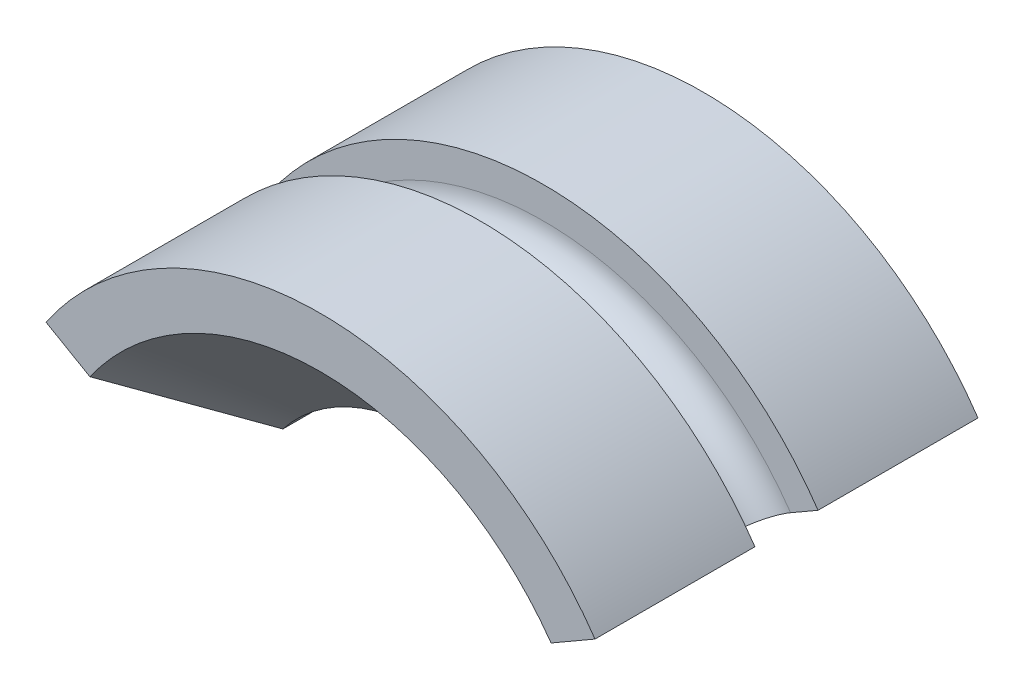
ISO-10303-21;
HEADER;
FILE_DESCRIPTION(('STEP AP214'),'2;1');
FILE_NAME('part.step','',(''),(''),'','','');
FILE_SCHEMA(('AUTOMOTIVE_DESIGN { 1 0 10303 214 1 1 1 1 }'));
ENDSEC;
DATA;
#1=APPLICATION_CONTEXT('core data for automotive mechanical design processes');
#2=APPLICATION_PROTOCOL_DEFINITION('international standard','automotive_design',2000,#1);
#3=PRODUCT_CONTEXT('',#1,'mechanical');
#4=PRODUCT('Part','Part','',(#3));
#5=PRODUCT_RELATED_PRODUCT_CATEGORY('part','',(#4));
#6=PRODUCT_DEFINITION_FORMATION('','',#4);
#7=PRODUCT_DEFINITION_CONTEXT('part definition',#1,'design');
#8=PRODUCT_DEFINITION('design','',#6,#7);
#9=PRODUCT_DEFINITION_SHAPE('','',#8);
#10=(LENGTH_UNIT() NAMED_UNIT(*) SI_UNIT(.MILLI.,.METRE.));
#11=(NAMED_UNIT(*) PLANE_ANGLE_UNIT() SI_UNIT($,.RADIAN.));
#12=(NAMED_UNIT(*) SI_UNIT($,.STERADIAN.) SOLID_ANGLE_UNIT());
#13=UNCERTAINTY_MEASURE_WITH_UNIT(LENGTH_MEASURE(1.E-05),#10,'distance_accuracy_value','');
#14=(GEOMETRIC_REPRESENTATION_CONTEXT(3) GLOBAL_UNCERTAINTY_ASSIGNED_CONTEXT((#13)) GLOBAL_UNIT_ASSIGNED_CONTEXT((#10,
#11,#12)) REPRESENTATION_CONTEXT('',''));
#15=CARTESIAN_POINT('',(0.,0.,0.));
#16=DIRECTION('',(0.,0.,1.));
#17=DIRECTION('',(1.,0.,0.));
#18=AXIS2_PLACEMENT_3D('',#15,#16,#17);
#19=CARTESIAN_POINT('',(0.,0.,0.));
#20=DIRECTION('',(0.,0.,-1.));
#21=DIRECTION('',(0.,1.,0.));
#22=AXIS2_PLACEMENT_3D('',#19,#20,#21);
#23=CYLINDRICAL_SURFACE('',#22,7.9);
#24=CARTESIAN_POINT('',(0.,0.,5.3));
#25=DIRECTION('',(0.,0.,-1.));
#26=DIRECTION('',(0.,1.,0.));
#27=AXIS2_PLACEMENT_3D('',#24,#25,#26);
#28=CIRCLE('',#27,7.9);
#29=CARTESIAN_POINT('',(-6.52183992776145,4.45820636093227,5.3));
#30=VERTEX_POINT('',#29);
#31=CARTESIAN_POINT('',(6.52183992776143,4.45820636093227,5.29999999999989));
#32=VERTEX_POINT('',#31);
#33=EDGE_CURVE('E109',#30,#32,#28,.T.);
#34=ORIENTED_EDGE('',*,*,#33,.F.);
#35=DIRECTION('',(0.,0.,-1.));
#36=VECTOR('',#35,1.);
#37=CARTESIAN_POINT('',(-6.52183992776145,4.45820636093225,9.1));
#38=LINE('',#37,#36);
#39=CARTESIAN_POINT('',(-6.52183992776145,4.45820636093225,9.1));
#40=VERTEX_POINT('',#39);
#41=EDGE_CURVE('E92',#40,#30,#38,.T.);
#42=ORIENTED_EDGE('',*,*,#41,.F.);
#43=CARTESIAN_POINT('',(0.,0.,9.1));
#44=DIRECTION('',(0.,0.,-1.));
#45=DIRECTION('',(0.,1.,0.));
#46=AXIS2_PLACEMENT_3D('',#43,#44,#45);
#47=CIRCLE('',#46,7.9);
#48=CARTESIAN_POINT('',(6.52183992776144,4.45820636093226,9.1));
#49=VERTEX_POINT('',#48);
#50=EDGE_CURVE('E107',#40,#49,#47,.T.);
#51=ORIENTED_EDGE('',*,*,#50,.T.);
#52=DIRECTION('',(0.,0.,-1.));
#53=VECTOR('',#52,1.);
#54=CARTESIAN_POINT('',(6.52183992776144,4.45820636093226,9.1));
#55=LINE('',#54,#53);
#56=EDGE_CURVE('E248',#49,#32,#55,.T.);
#57=ORIENTED_EDGE('',*,*,#56,.T.);
#58=EDGE_LOOP('',(#34,#42,#51,#57));
#59=FACE_BOUND('',#58,.T.);
#60=ADVANCED_FACE('F14',(#59),#23,.T.);
#61=CARTESIAN_POINT('',(0.,0.,9.1));
#62=DIRECTION('',(0.,0.,1.));
#63=DIRECTION('',(0.,-1.,0.));
#64=AXIS2_PLACEMENT_3D('',#61,#62,#63);
#65=CONICAL_SURFACE('',#64,6.7,0.785398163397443);
#66=CARTESIAN_POINT('',(0.,0.,9.1));
#67=DIRECTION('',(0.,0.,-1.));
#68=DIRECTION('',(0.,1.,0.));
#69=AXIS2_PLACEMENT_3D('',#66,#67,#68);
#70=CIRCLE('',#69,6.7);
#71=CARTESIAN_POINT('',(-5.47905701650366,3.85615536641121,9.1));
#72=VERTEX_POINT('',#71);
#73=CARTESIAN_POINT('',(5.47905701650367,3.85615536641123,9.1));
#74=VERTEX_POINT('',#73);
#75=EDGE_CURVE('E116',#72,#74,#70,.T.);
#76=ORIENTED_EDGE('',*,*,#75,.F.);
#77=CARTESIAN_POINT('',(-5.4792309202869,3.85625576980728,9.1002));
#78=CARTESIAN_POINT('',(-5.30146466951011,3.75362237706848,8.8957612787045));
#79=CARTESIAN_POINT('',(-5.12366859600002,3.65097176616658,8.69135711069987));
#80=CARTESIAN_POINT('',(-4.76798819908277,3.44561959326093,8.28265139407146));
#81=CARTESIAN_POINT('',(-4.59010387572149,3.34291803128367,8.07834984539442));
#82=CARTESIAN_POINT('',(-4.23421813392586,3.13744730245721,7.66988260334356));
#83=CARTESIAN_POINT('',(-4.05621671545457,3.03467813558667,7.46571691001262));
#84=CARTESIAN_POINT('',(-3.70003888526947,2.82903876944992,7.05758895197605));
#85=CARTESIAN_POINT('',(-3.52186247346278,2.7261685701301,6.85362668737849));
#86=CARTESIAN_POINT('',(-3.34356968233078,2.62323117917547,6.6498));
#87=B_SPLINE_CURVE_WITH_KNOTS('',3,(#77,#78,#79,#80,#81,#82,#83,#84,#85,#86),.UNSPECIFIED.,.F.,
.F.,(4,2,2,2,4),(0.,0.869118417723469,1.73823638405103,2.60735462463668,3.47647332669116),.UNSPECIFIED.);
#88=CARTESIAN_POINT('',(-3.34374463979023,2.62333219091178,6.65));
#89=VERTEX_POINT('',#88);
#90=EDGE_CURVE('E95',#72,#89,#87,.T.);
#91=ORIENTED_EDGE('',*,*,#90,.T.);
#92=CARTESIAN_POINT('',(0.,0.,6.65));
#93=DIRECTION('',(0.,0.,-1.));
#94=DIRECTION('',(0.,1.,0.));
#95=AXIS2_PLACEMENT_3D('',#92,#93,#94);
#96=CIRCLE('',#95,4.25);
#97=CARTESIAN_POINT('',(3.34374463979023,2.6233321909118,6.65));
#98=VERTEX_POINT('',#97);
#99=EDGE_CURVE('E130',#89,#98,#96,.T.);
#100=ORIENTED_EDGE('',*,*,#99,.T.);
#101=CARTESIAN_POINT('',(3.34356968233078,2.62323117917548,6.6498));
#102=CARTESIAN_POINT('',(3.52186247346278,2.7261685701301,6.8536266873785));
#103=CARTESIAN_POINT('',(3.70003888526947,2.82903876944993,7.05758895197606));
#104=CARTESIAN_POINT('',(4.05621671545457,3.03467813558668,7.46571691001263));
#105=CARTESIAN_POINT('',(4.23421813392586,3.13744730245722,7.66988260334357));
#106=CARTESIAN_POINT('',(4.59010387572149,3.34291803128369,8.07834984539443));
#107=CARTESIAN_POINT('',(4.76798819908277,3.44561959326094,8.28265139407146));
#108=CARTESIAN_POINT('',(5.12366859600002,3.65097176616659,8.69135711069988));
#109=CARTESIAN_POINT('',(5.30146466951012,3.7536223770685,8.89576127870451));
#110=CARTESIAN_POINT('',(5.47923092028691,3.8562557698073,9.1002));
#111=B_SPLINE_CURVE_WITH_KNOTS('',3,(#101,#102,#103,#104,#105,#106,#107,#108,#109,#110),
.UNSPECIFIED.,.F.,.F.,(4,2,2,2,4),(0.,0.869118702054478,1.73823694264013,2.60735490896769,
3.47647332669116),.UNSPECIFIED.);
#112=EDGE_CURVE('E181',#98,#74,#111,.T.);
#113=ORIENTED_EDGE('',*,*,#112,.T.);
#114=EDGE_LOOP('',(#76,#91,#100,#113));
#115=FACE_BOUND('',#114,.T.);
#116=ADVANCED_FACE('F16',(#115),#65,.F.);
#117=CARTESIAN_POINT('',(0.,0.,0.));
#118=DIRECTION('',(0.,0.,-1.));
#119=DIRECTION('',(0.,1.,0.));
#120=AXIS2_PLACEMENT_3D('',#117,#118,#119);
#121=CYLINDRICAL_SURFACE('',#120,4.25);
#122=ORIENTED_EDGE('',*,*,#99,.F.);
#123=DIRECTION('',(0.,0.,-1.));
#124=VECTOR('',#123,1.);
#125=CARTESIAN_POINT('',(-3.34374463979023,2.6233321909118,9.1));
#126=LINE('',#125,#124);
#127=CARTESIAN_POINT('',(-3.34374463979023,2.62333219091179,2.45));
#128=VERTEX_POINT('',#127);
#129=EDGE_CURVE('E110',#89,#128,#126,.T.);
#130=ORIENTED_EDGE('',*,*,#129,.T.);
#131=CARTESIAN_POINT('',(0.,0.,2.45000000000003));
#132=DIRECTION('',(0.,0.,-1.));
#133=DIRECTION('',(0.,1.,0.));
#134=AXIS2_PLACEMENT_3D('',#131,#132,#133);
#135=CIRCLE('',#134,4.25);
#136=CARTESIAN_POINT('',(3.34374463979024,2.6233321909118,2.45));
#137=VERTEX_POINT('',#136);
#138=EDGE_CURVE('E127',#128,#137,#135,.T.);
#139=ORIENTED_EDGE('',*,*,#138,.T.);
#140=DIRECTION('',(0.,0.,-1.));
#141=VECTOR('',#140,1.);
#142=CARTESIAN_POINT('',(3.34374463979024,2.62333219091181,9.1));
#143=LINE('',#142,#141);
#144=EDGE_CURVE('E246',#98,#137,#143,.T.);
#145=ORIENTED_EDGE('',*,*,#144,.F.);
#146=EDGE_LOOP('',(#122,#130,#139,#145));
#147=FACE_BOUND('',#146,.T.);
#148=ADVANCED_FACE('F209',(#147),#121,.F.);
#149=CARTESIAN_POINT('',(0.,0.,2.45000000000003));
#150=DIRECTION('',(0.,0.,-1.));
#151=DIRECTION('',(0.,1.,0.));
#152=AXIS2_PLACEMENT_3D('',#149,#150,#151);
#153=CONICAL_SURFACE('',#152,4.25,0.785398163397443);
#154=ORIENTED_EDGE('',*,*,#138,.F.);
#155=CARTESIAN_POINT('',(-3.34356968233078,2.62323117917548,2.4502));
#156=CARTESIAN_POINT('',(-3.52186247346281,2.72616857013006,2.2463733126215));
#157=CARTESIAN_POINT('',(-3.70003888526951,2.82903876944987,2.04241104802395));
#158=CARTESIAN_POINT('',(-4.05621671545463,3.0346781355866,1.63428308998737));
#159=CARTESIAN_POINT('',(-4.23421813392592,3.13744730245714,1.43011739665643));
#160=CARTESIAN_POINT('',(-4.59010387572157,3.34291803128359,1.02165015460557));
#161=CARTESIAN_POINT('',(-4.76798819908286,3.44561959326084,0.817348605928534));
#162=CARTESIAN_POINT('',(-5.1236685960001,3.6509717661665,0.408642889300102));
#163=CARTESIAN_POINT('',(-5.30146466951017,3.75362237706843,0.20423872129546));
#164=CARTESIAN_POINT('',(-5.47923092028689,3.85625576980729,-0.000200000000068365));
#165=B_SPLINE_CURVE_WITH_KNOTS('',3,(#155,#156,#157,#158,#159,#160,#161,#162,#163,#164),
.UNSPECIFIED.,.F.,.F.,(4,2,2,2,4),(0.,0.869118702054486,1.73823694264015,2.60735490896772,
3.4764733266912),.UNSPECIFIED.);
#166=CARTESIAN_POINT('',(-5.47905701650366,3.85615536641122,0.));
#167=VERTEX_POINT('',#166);
#168=EDGE_CURVE('E160',#128,#167,#165,.T.);
#169=ORIENTED_EDGE('',*,*,#168,.T.);
#170=CARTESIAN_POINT('',(0.,0.,0.));
#171=DIRECTION('',(0.,0.,-1.));
#172=DIRECTION('',(0.,1.,0.));
#173=AXIS2_PLACEMENT_3D('',#170,#171,#172);
#174=CIRCLE('',#173,6.7);
#175=CARTESIAN_POINT('',(5.47905701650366,3.85615536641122,0.));
#176=VERTEX_POINT('',#175);
#177=EDGE_CURVE('E119',#167,#176,#174,.T.);
#178=ORIENTED_EDGE('',*,*,#177,.T.);
#179=CARTESIAN_POINT('',(5.47923092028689,3.85625576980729,-0.000200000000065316));
#180=CARTESIAN_POINT('',(5.30146466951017,3.75362237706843,0.204238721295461));
#181=CARTESIAN_POINT('',(5.1236685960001,3.6509717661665,0.408642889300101));
#182=CARTESIAN_POINT('',(4.76798819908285,3.44561959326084,0.817348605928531));
#183=CARTESIAN_POINT('',(4.59010387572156,3.3429180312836,1.02165015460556));
#184=CARTESIAN_POINT('',(4.23421813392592,3.13744730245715,1.43011739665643));
#185=CARTESIAN_POINT('',(4.05621671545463,3.03467813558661,1.63428308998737));
#186=CARTESIAN_POINT('',(3.70003888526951,2.82903876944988,2.04241104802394));
#187=CARTESIAN_POINT('',(3.52186247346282,2.72616857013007,2.2463733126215));
#188=CARTESIAN_POINT('',(3.34356968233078,2.62323117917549,2.4502));
#189=B_SPLINE_CURVE_WITH_KNOTS('',3,(#179,#180,#181,#182,#183,#184,#185,#186,#187,#188),
.UNSPECIFIED.,.F.,.F.,(4,2,2,2,4),(0.,0.869118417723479,1.73823638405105,2.60735462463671,
3.4764733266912),.UNSPECIFIED.);
#190=EDGE_CURVE('E198',#176,#137,#189,.T.);
#191=ORIENTED_EDGE('',*,*,#190,.T.);
#192=EDGE_LOOP('',(#154,#169,#178,#191));
#193=FACE_BOUND('',#192,.T.);
#194=ADVANCED_FACE('F204',(#193),#153,.F.);
#195=CARTESIAN_POINT('',(6.7,0.,0.));
#196=DIRECTION('',(0.,0.,-1.));
#197=DIRECTION('',(0.,1.,0.));
#198=AXIS2_PLACEMENT_3D('',#195,#196,#197);
#199=PLANE('',#198);
#200=ORIENTED_EDGE('',*,*,#177,.F.);
#201=DIRECTION('',(-0.86602540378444,0.5,0.));
#202=VECTOR('',#201,1.);
#203=CARTESIAN_POINT('',(-3.34374463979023,2.62333219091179,0.));
#204=LINE('',#203,#202);
#205=CARTESIAN_POINT('',(-6.52183992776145,4.45820636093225,0.));
#206=VERTEX_POINT('',#205);
#207=EDGE_CURVE('E240',#167,#206,#204,.T.);
#208=ORIENTED_EDGE('',*,*,#207,.T.);
#209=CARTESIAN_POINT('',(0.,0.,0.));
#210=DIRECTION('',(0.,0.,-1.));
#211=DIRECTION('',(0.,1.,0.));
#212=AXIS2_PLACEMENT_3D('',#209,#210,#211);
#213=CIRCLE('',#212,7.9);
#214=CARTESIAN_POINT('',(6.52183992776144,4.45820636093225,0.));
#215=VERTEX_POINT('',#214);
#216=EDGE_CURVE('E115',#206,#215,#213,.T.);
#217=ORIENTED_EDGE('',*,*,#216,.T.);
#218=DIRECTION('',(-0.866025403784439,-0.5,0.));
#219=VECTOR('',#218,1.);
#220=CARTESIAN_POINT('',(3.34374463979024,2.6233321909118,0.));
#221=LINE('',#220,#219);
#222=EDGE_CURVE('E101',#215,#176,#221,.T.);
#223=ORIENTED_EDGE('',*,*,#222,.T.);
#224=EDGE_LOOP('',(#200,#208,#217,#223));
#225=FACE_BOUND('',#224,.T.);
#226=ADVANCED_FACE('F208',(#225),#199,.T.);
#227=ORIENTED_EDGE('',*,*,#216,.F.);
#228=CARTESIAN_POINT('',(-6.52183992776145,4.45820636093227,3.79999999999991));
#229=VERTEX_POINT('',#228);
#230=EDGE_CURVE('E111',#229,#206,#38,.T.);
#231=ORIENTED_EDGE('',*,*,#230,.F.);
#232=CARTESIAN_POINT('',(0.,0.,3.8));
#233=DIRECTION('',(0.,0.,-1.));
#234=DIRECTION('',(0.,1.,0.));
#235=AXIS2_PLACEMENT_3D('',#232,#233,#234);
#236=CIRCLE('',#235,7.9);
#237=CARTESIAN_POINT('',(6.52183992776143,4.45820636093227,3.7999999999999));
#238=VERTEX_POINT('',#237);
#239=EDGE_CURVE('E149',#229,#238,#236,.T.);
#240=ORIENTED_EDGE('',*,*,#239,.T.);
#241=EDGE_CURVE('E37',#238,#215,#55,.T.);
#242=ORIENTED_EDGE('',*,*,#241,.T.);
#243=EDGE_LOOP('',(#227,#231,#240,#242));
#244=FACE_BOUND('',#243,.T.);
#245=ADVANCED_FACE('F223',(#244),#23,.T.);
#246=CARTESIAN_POINT('',(7.9,0.,9.1));
#247=DIRECTION('',(0.,0.,1.));
#248=DIRECTION('',(0.,-1.,0.));
#249=AXIS2_PLACEMENT_3D('',#246,#247,#248);
#250=PLANE('',#249);
#251=ORIENTED_EDGE('',*,*,#50,.F.);
#252=DIRECTION('',(-0.86602540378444,0.5,0.));
#253=VECTOR('',#252,1.);
#254=CARTESIAN_POINT('',(-3.34374463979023,2.6233321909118,9.1));
#255=LINE('',#254,#253);
#256=EDGE_CURVE('E89',#72,#40,#255,.T.);
#257=ORIENTED_EDGE('',*,*,#256,.F.);
#258=ORIENTED_EDGE('',*,*,#75,.T.);
#259=DIRECTION('',(-0.866025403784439,-0.5,0.));
#260=VECTOR('',#259,1.);
#261=CARTESIAN_POINT('',(3.34374463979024,2.62333219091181,9.1));
#262=LINE('',#261,#260);
#263=EDGE_CURVE('E100',#49,#74,#262,.T.);
#264=ORIENTED_EDGE('',*,*,#263,.F.);
#265=EDGE_LOOP('',(#251,#257,#258,#264));
#266=FACE_BOUND('',#265,.T.);
#267=ADVANCED_FACE('F114',(#266),#250,.T.);
#268=CARTESIAN_POINT('',(7.9,0.,5.3));
#269=DIRECTION('',(0.,0.,1.));
#270=DIRECTION('',(0.,-1.,0.));
#271=AXIS2_PLACEMENT_3D('',#268,#269,#270);
#272=PLANE('',#271);
#273=DIRECTION('',(0.86602540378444,-0.5,0.));
#274=VECTOR('',#273,1.);
#275=CARTESIAN_POINT('',(6.225,-2.90118510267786,5.3));
#276=LINE('',#275,#274);
#277=CARTESIAN_POINT('',(-5.87024108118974,4.08200559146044,5.30000000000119));
#278=VERTEX_POINT('',#277);
#279=EDGE_CURVE('E180',#30,#278,#276,.T.);
#280=ORIENTED_EDGE('',*,*,#279,.F.);
#281=ORIENTED_EDGE('',*,*,#33,.T.);
#282=DIRECTION('',(0.86602540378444,0.5,0.));
#283=VECTOR('',#282,1.);
#284=CARTESIAN_POINT('',(5.625,3.94041558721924,5.3));
#285=LINE('',#284,#283);
#286=CARTESIAN_POINT('',(5.87024108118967,4.08200559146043,5.30000000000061));
#287=VERTEX_POINT('',#286);
#288=EDGE_CURVE('E146',#287,#32,#285,.T.);
#289=ORIENTED_EDGE('',*,*,#288,.F.);
#290=CARTESIAN_POINT('',(0.,0.,5.3));
#291=DIRECTION('',(0.,0.,-1.));
#292=DIRECTION('',(0.,1.,0.));
#293=AXIS2_PLACEMENT_3D('',#290,#291,#292);
#294=CIRCLE('',#293,7.15);
#295=EDGE_CURVE('E121',#278,#287,#294,.T.);
#296=ORIENTED_EDGE('',*,*,#295,.F.);
#297=EDGE_LOOP('',(#280,#281,#289,#296));
#298=FACE_BOUND('',#297,.T.);
#299=ADVANCED_FACE('F190',(#298),#272,.F.);
#300=CARTESIAN_POINT('',(0.,0.,4.55));
#301=DIRECTION('',(0.,0.,-1.));
#302=DIRECTION('',(0.,1.,0.));
#303=AXIS2_PLACEMENT_3D('',#300,#301,#302);
#304=TOROIDAL_SURFACE('',#303,7.15,0.75);
#305=CARTESIAN_POINT('',(-6.2848657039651,4.32138922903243,3.9713852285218));
#306=CARTESIAN_POINT('',(-6.31304693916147,4.33765967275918,3.99814096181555));
#307=CARTESIAN_POINT('',(-6.33929585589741,4.35281449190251,4.02765777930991));
#308=CARTESIAN_POINT('',(-6.38715377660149,4.38044527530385,4.09138311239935));
#309=CARTESIAN_POINT('',(-6.4087573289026,4.39291809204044,4.1255970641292));
#310=CARTESIAN_POINT('',(-6.44667219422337,4.41480824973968,4.19772156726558));
#311=CARTESIAN_POINT('',(-6.46298542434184,4.42422669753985,4.23563077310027));
#312=CARTESIAN_POINT('',(-6.48985247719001,4.43973839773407,4.31406780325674));
#313=CARTESIAN_POINT('',(-6.50040771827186,4.44583246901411,4.35459497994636));
#314=CARTESIAN_POINT('',(-6.51544793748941,4.45451594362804,4.43705356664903));
#315=CARTESIAN_POINT('',(-6.5199430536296,4.45711120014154,4.47898251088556));
#316=CARTESIAN_POINT('',(-6.52276588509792,4.45874096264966,4.56311766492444));
#317=CARTESIAN_POINT('',(-6.52109341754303,4.4577753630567,4.60532388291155));
#318=CARTESIAN_POINT('',(-6.51163446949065,4.45231423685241,4.68876388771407));
#319=CARTESIAN_POINT('',(-6.50385489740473,4.44782269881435,4.72999871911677));
#320=CARTESIAN_POINT('',(-6.48241437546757,4.43544400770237,4.81037621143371));
#321=CARTESIAN_POINT('',(-6.46875343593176,4.42755686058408,4.84951887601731));
#322=CARTESIAN_POINT('',(-6.43593266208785,4.40860777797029,4.9246284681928));
#323=CARTESIAN_POINT('',(-6.41676951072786,4.39754392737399,4.96059346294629));
#324=CARTESIAN_POINT('',(-6.37349661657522,4.37256031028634,5.02830817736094));
#325=CARTESIAN_POINT('',(-6.34938683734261,4.35864052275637,5.06005786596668));
#326=CARTESIAN_POINT('',(-6.29685174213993,4.32830937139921,5.11851525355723));
#327=CARTESIAN_POINT('',(-6.26841732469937,4.31189275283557,5.14521204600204));
#328=CARTESIAN_POINT('',(-6.20808024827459,4.27705712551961,5.19273396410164));
#329=CARTESIAN_POINT('',(-6.1761775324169,4.25863808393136,5.2135589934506));
#330=CARTESIAN_POINT('',(-6.10970746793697,4.22026157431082,5.24881266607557));
#331=CARTESIAN_POINT('',(-6.07513242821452,4.20029966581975,5.26322197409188));
#332=CARTESIAN_POINT('',(-6.00438136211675,4.15945151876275,5.28515434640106));
#333=CARTESIAN_POINT('',(-5.96820530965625,4.13856526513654,5.29267729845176));
#334=CARTESIAN_POINT('',(-5.89517125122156,4.09639903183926,5.30064217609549));
#335=CARTESIAN_POINT('',(-5.85831162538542,4.07511811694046,5.30106430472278));
#336=CARTESIAN_POINT('',(-5.7850524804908,4.03282192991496,5.29476769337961));
#337=CARTESIAN_POINT('',(-5.74865296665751,4.01180666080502,5.2880488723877));
#338=CARTESIAN_POINT('',(-5.67729578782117,3.97060857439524,5.26764500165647));
#339=CARTESIAN_POINT('',(-5.64234015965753,3.9504269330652,5.25395045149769));
#340=CARTESIAN_POINT('',(-5.57491856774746,3.91150105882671,5.21997325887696));
#341=CARTESIAN_POINT('',(-5.54245260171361,3.89275682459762,5.199690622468));
#342=CARTESIAN_POINT('',(-5.48096818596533,3.85725878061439,5.15312777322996));
#343=CARTESIAN_POINT('',(-5.45194651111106,3.84050310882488,5.12685323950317));
#344=CARTESIAN_POINT('',(-5.39815040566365,3.80944391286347,5.06903459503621));
#345=CARTESIAN_POINT('',(-5.37337591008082,3.79514035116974,5.03749056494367));
#346=CARTESIAN_POINT('',(-5.32886443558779,3.76944163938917,4.97013385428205));
#347=CARTESIAN_POINT('',(-5.30911163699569,3.75803735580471,4.93433511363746));
#348=CARTESIAN_POINT('',(-5.27511612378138,3.73841003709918,4.85940432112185));
#349=CARTESIAN_POINT('',(-5.26087327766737,3.73018692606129,4.82027234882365));
#350=CARTESIAN_POINT('',(-5.23836165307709,3.71718983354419,4.73995704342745));
#351=CARTESIAN_POINT('',(-5.23006877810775,3.71240193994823,4.69878271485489));
#352=CARTESIAN_POINT('',(-5.2196059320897,3.70636121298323,4.6154097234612));
#353=CARTESIAN_POINT('',(-5.21743584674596,3.70510831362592,4.57321107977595));
#354=CARTESIAN_POINT('',(-5.21927953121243,3.70617276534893,4.48911262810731));
#355=CARTESIAN_POINT('',(-5.22327607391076,3.70848017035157,4.44721231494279));
#356=CARTESIAN_POINT('',(-5.23730408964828,3.71657924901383,4.36478149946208));
#357=CARTESIAN_POINT('',(-5.2473355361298,3.72237090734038,4.32425099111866));
#358=CARTESIAN_POINT('',(-5.2731428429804,3.73727076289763,4.24570163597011));
#359=CARTESIAN_POINT('',(-5.28891939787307,3.74637936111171,4.20768309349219));
#360=CARTESIAN_POINT('',(-5.32576062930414,3.76764965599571,4.13523167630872));
#361=CARTESIAN_POINT('',(-5.34682538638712,3.77981139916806,4.10079885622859));
#362=CARTESIAN_POINT('',(-5.39370858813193,3.8068794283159,4.03638526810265));
#363=CARTESIAN_POINT('',(-5.41954085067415,3.82179369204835,4.00641791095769));
#364=CARTESIAN_POINT('',(-5.47518028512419,3.85391713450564,3.95189140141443));
#365=CARTESIAN_POINT('',(-5.50498755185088,3.87112636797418,3.92733237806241));
#366=CARTESIAN_POINT('',(-5.5678617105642,3.90742678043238,3.88421463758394));
#367=CARTESIAN_POINT('',(-5.60094141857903,3.92652535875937,3.86568083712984));
#368=CARTESIAN_POINT('',(-5.6693191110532,3.96600323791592,3.83526716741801));
#369=CARTESIAN_POINT('',(-5.70461705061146,3.98638251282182,3.82338716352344));
#370=CARTESIAN_POINT('',(-5.77654310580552,4.02790904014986,3.80658528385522));
#371=CARTESIAN_POINT('',(-5.81317485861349,4.04905839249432,3.80168416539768));
#372=CARTESIAN_POINT('',(-5.88664150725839,4.0914743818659,3.79904580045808));
#373=CARTESIAN_POINT('',(-5.92347645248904,4.1127410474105,3.80131038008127));
#374=CARTESIAN_POINT('',(-5.99633856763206,4.15480800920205,3.81295165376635));
#375=CARTESIAN_POINT('',(-6.03236464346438,4.17560767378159,3.82233744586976));
#376=CARTESIAN_POINT('',(-6.10250543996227,4.21610348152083,3.84796804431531));
#377=CARTESIAN_POINT('',(-6.13662240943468,4.23580092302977,3.8642045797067));
#378=CARTESIAN_POINT('',(-6.18983460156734,4.26652299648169,3.89583219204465));
#379=CARTESIAN_POINT('',(-6.20980512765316,4.27805298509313,3.90930008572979));
#380=CARTESIAN_POINT('',(-6.24839732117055,4.300334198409,3.93860462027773));
#381=CARTESIAN_POINT('',(-6.26701898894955,4.31108542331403,3.95444126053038));
#382=CARTESIAN_POINT('',(-6.2848657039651,4.32138922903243,3.9713852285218));
#383=B_SPLINE_CURVE_WITH_KNOTS('',3,(#305,#306,#307,#308,#309,#310,#311,#312,#313,#314,#315,
#316,#317,#318,#319,#320,#321,#322,#323,#324,#325,#326,#327,#328,#329,#330,#331,#332,#333,#334,
#335,#336,#337,#338,#339,#340,#341,#342,#343,#344,#345,#346,#347,#348,#349,#350,#351,#352,#353,
#354,#355,#356,#357,#358,#359,#360,#361,#362,#363,#364,#365,#366,#367,#368,#369,#370,#371,#372,
#373,#374,#375,#376,#377,#378,#379,#380,#381,#382),.UNSPECIFIED.,.T.,.F.,(4,2,2,2,2,2,2,2,2,2,2,
2,2,2,2,2,2,2,2,2,2,2,2,2,2,2,2,2,2,2,2,2,2,2,2,2,2,2,4),(0.,0.126287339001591,
0.252722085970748,0.379110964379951,0.505468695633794,0.631614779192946,0.75776460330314,
0.883771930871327,1.00977903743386,1.13586226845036,1.26194642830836,1.38829970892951,
1.51465506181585,1.64138868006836,1.7681243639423,1.89521332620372,2.02230373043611,
2.14956768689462,2.27683152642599,2.40397524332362,2.53111701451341,2.65785314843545,
2.78458625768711,2.91080317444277,3.03701773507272,3.16288034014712,3.28874239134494,
3.41461966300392,3.54049885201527,3.66674878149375,3.79300172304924,3.91977031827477,
4.04653634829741,4.1736786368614,4.3008533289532,4.42819077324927,4.55537492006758,
4.6353506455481,4.71532635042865),.UNSPECIFIED.);
#384=CARTESIAN_POINT('',(-5.87024108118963,4.08200559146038,3.79999999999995));
#385=VERTEX_POINT('',#384);
#386=EDGE_CURVE('E29',#278,#385,#383,.T.);
#387=ORIENTED_EDGE('',*,*,#386,.F.);
#388=ORIENTED_EDGE('',*,*,#295,.T.);
#389=CARTESIAN_POINT('',(5.24944298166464,3.72358764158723,4.77949148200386));
#390=CARTESIAN_POINT('',(5.26064998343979,3.73005800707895,4.81957294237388));
#391=CARTESIAN_POINT('',(5.27480516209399,3.73823050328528,4.85858815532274));
#392=CARTESIAN_POINT('',(5.3086059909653,3.75774542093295,4.93334840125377));
#393=CARTESIAN_POINT('',(5.32825842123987,3.76909175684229,4.96908932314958));
#394=CARTESIAN_POINT('',(5.37246611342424,3.79461507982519,5.03623714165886));
#395=CARTESIAN_POINT('',(5.39701819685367,3.80879023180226,5.06764682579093));
#396=CARTESIAN_POINT('',(5.45032151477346,3.83956491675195,5.1252690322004));
#397=CARTESIAN_POINT('',(5.47907172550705,3.85616385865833,5.15148281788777));
#398=CARTESIAN_POINT('',(5.54005317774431,3.89137151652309,5.19806845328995));
#399=CARTESIAN_POINT('',(5.57229479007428,3.90998622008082,5.21842220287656));
#400=CARTESIAN_POINT('',(5.63927381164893,3.948656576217,5.25261534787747));
#401=CARTESIAN_POINT('',(5.67401136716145,3.96871231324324,5.26645436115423));
#402=CARTESIAN_POINT('',(5.74511887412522,4.00976625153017,5.28726704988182));
#403=CARTESIAN_POINT('',(5.78149384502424,4.0307673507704,5.2942178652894));
#404=CARTESIAN_POINT('',(5.85473827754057,4.07305504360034,5.30097849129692));
#405=CARTESIAN_POINT('',(5.89160774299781,4.09434163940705,5.30078824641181));
#406=CARTESIAN_POINT('',(5.96483961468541,4.13662208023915,5.29326480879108));
#407=CARTESIAN_POINT('',(6.00120138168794,4.15761555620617,5.28592331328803));
#408=CARTESIAN_POINT('',(6.07233906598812,4.19868691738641,5.2642872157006));
#409=CARTESIAN_POINT('',(6.10711499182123,4.21876480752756,5.24999265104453));
#410=CARTESIAN_POINT('',(6.17404782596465,4.25740849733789,5.21486983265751));
#411=CARTESIAN_POINT('',(6.20620779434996,4.27597606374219,5.19404935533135));
#412=CARTESIAN_POINT('',(6.26703313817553,4.31109359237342,5.14645328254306));
#413=CARTESIAN_POINT('',(6.29569855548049,4.32764357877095,5.11967775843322));
#414=CARTESIAN_POINT('',(6.34863691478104,4.35820755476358,5.06100846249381));
#415=CARTESIAN_POINT('',(6.37292158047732,4.37222831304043,5.02912879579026));
#416=CARTESIAN_POINT('',(6.41649419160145,4.39738497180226,4.96110197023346));
#417=CARTESIAN_POINT('',(6.43578222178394,4.40852092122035,4.92495488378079));
#418=CARTESIAN_POINT('',(6.46875323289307,4.42755674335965,4.84953709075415));
#419=CARTESIAN_POINT('',(6.48245300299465,4.43546630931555,4.81027617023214));
#420=CARTESIAN_POINT('',(6.50393533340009,4.44786913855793,4.72965216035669));
#421=CARTESIAN_POINT('',(6.51171797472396,4.45236244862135,4.68828909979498));
#422=CARTESIAN_POINT('',(6.52113023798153,4.45779662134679,4.60473403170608));
#423=CARTESIAN_POINT('',(6.52277355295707,4.45874538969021,4.56254408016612));
#424=CARTESIAN_POINT('',(6.51989776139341,4.45708505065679,4.47844533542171));
#425=CARTESIAN_POINT('',(6.51537869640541,4.45447596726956,4.43653654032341));
#426=CARTESIAN_POINT('',(6.50031416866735,4.44577845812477,4.35422106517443));
#427=CARTESIAN_POINT('',(6.48977308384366,4.43969255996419,4.31381331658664));
#428=CARTESIAN_POINT('',(6.46297115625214,4.42421845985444,4.2356119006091));
#429=CARTESIAN_POINT('',(6.44671029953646,4.41483024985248,4.19781823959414));
#430=CARTESIAN_POINT('',(6.40891632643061,4.39300988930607,4.12587543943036));
#431=CARTESIAN_POINT('',(6.38737799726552,4.38057472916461,4.09172995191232));
#432=CARTESIAN_POINT('',(6.33965352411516,4.35302099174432,4.02808639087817));
#433=CARTESIAN_POINT('',(6.31346733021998,4.33790238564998,3.99858836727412));
#434=CARTESIAN_POINT('',(6.25712426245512,4.30537270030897,3.94499939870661));
#435=CARTESIAN_POINT('',(6.22695797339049,4.28795618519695,3.9209216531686));
#436=CARTESIAN_POINT('',(6.16356136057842,4.25135413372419,3.87893511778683));
#437=CARTESIAN_POINT('',(6.1303309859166,4.23216856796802,3.86102643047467));
#438=CARTESIAN_POINT('',(6.06164095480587,4.19251036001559,3.83182888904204));
#439=CARTESIAN_POINT('',(6.02617480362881,4.1720339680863,3.82056040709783));
#440=CARTESIAN_POINT('',(5.95410923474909,4.13042689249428,3.80503922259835));
#441=CARTESIAN_POINT('',(5.91750980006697,4.10929619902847,3.80078662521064));
#442=CARTESIAN_POINT('',(5.84411644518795,4.06692252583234,3.79941068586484));
#443=CARTESIAN_POINT('',(5.80732226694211,4.0456793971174,3.80230564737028));
#444=CARTESIAN_POINT('',(5.73467527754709,4.00373663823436,3.81518036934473));
#445=CARTESIAN_POINT('',(5.69882247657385,3.98303701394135,3.82516020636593));
#446=CARTESIAN_POINT('',(5.6290443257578,3.94275057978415,3.85193730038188));
#447=CARTESIAN_POINT('',(5.59512070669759,3.92316476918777,3.86874057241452));
#448=CARTESIAN_POINT('',(5.53020286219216,3.88568443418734,3.90869451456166));
#449=CARTESIAN_POINT('',(5.49920862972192,3.8677899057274,3.93184516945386));
#450=CARTESIAN_POINT('',(5.44108275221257,3.8342309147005,3.98380468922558));
#451=CARTESIAN_POINT('',(5.41394539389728,3.818563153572,4.01260503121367));
#452=CARTESIAN_POINT('',(5.36426259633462,3.7898787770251,4.07507342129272));
#453=CARTESIAN_POINT('',(5.34171689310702,3.77686200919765,4.10874118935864));
#454=CARTESIAN_POINT('',(5.30194556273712,3.75390002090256,4.17985844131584));
#455=CARTESIAN_POINT('',(5.28470073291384,3.74394371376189,4.21729360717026));
#456=CARTESIAN_POINT('',(5.25591958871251,3.72732691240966,4.29499589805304));
#457=CARTESIAN_POINT('',(5.24438456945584,3.72066716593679,4.33526366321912));
#458=CARTESIAN_POINT('',(5.22739730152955,3.71085956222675,4.41732190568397));
#459=CARTESIAN_POINT('',(5.22192394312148,3.7076995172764,4.45910657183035));
#460=CARTESIAN_POINT('',(5.21715524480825,3.7049463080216,4.54310812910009));
#461=CARTESIAN_POINT('',(5.21785231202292,3.70534875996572,4.58532442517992));
#462=CARTESIAN_POINT('',(5.22393753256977,3.70886206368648,4.65300843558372));
#463=CARTESIAN_POINT('',(5.22743486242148,3.71088124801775,4.67872230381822));
#464=CARTESIAN_POINT('',(5.23672782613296,3.71624654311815,4.72959009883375));
#465=CARTESIAN_POINT('',(5.2425234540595,3.71959265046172,4.75474402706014));
#466=CARTESIAN_POINT('',(5.24944298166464,3.72358764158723,4.77949148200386));
#467=B_SPLINE_CURVE_WITH_KNOTS('',3,(#389,#390,#391,#392,#393,#394,#395,#396,#397,#398,#399,
#400,#401,#402,#403,#404,#405,#406,#407,#408,#409,#410,#411,#412,#413,#414,#415,#416,#417,#418,
#419,#420,#421,#422,#423,#424,#425,#426,#427,#428,#429,#430,#431,#432,#433,#434,#435,#436,#437,
#438,#439,#440,#441,#442,#443,#444,#445,#446,#447,#448,#449,#450,#451,#452,#453,#454,#455,#456,
#457,#458,#459,#460,#461,#462,#463,#464,#465,#466),.UNSPECIFIED.,.T.,.F.,(4,2,2,2,2,2,2,2,2,2,2,
2,2,2,2,2,2,2,2,2,2,2,2,2,2,2,2,2,2,2,2,2,2,2,2,2,2,2,4),(0.,0.126260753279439,
0.252677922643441,0.379013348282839,0.505318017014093,0.632008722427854,0.758706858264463,
0.885824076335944,1.01294228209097,1.14020825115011,1.267473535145,1.39458774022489,
1.52170042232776,1.64846771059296,1.77523284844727,1.90161428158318,2.02799398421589,
2.15409164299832,2.28018845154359,2.40619370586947,2.53219926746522,2.65832979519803,
2.78446167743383,2.91089747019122,3.03733536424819,3.16415917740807,3.29098489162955,
3.4181357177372,3.54528791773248,3.67255244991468,3.79981667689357,3.92689037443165,
4.05395676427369,4.1805572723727,4.30718648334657,4.43337330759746,4.55940487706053,
4.63736212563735,4.71531917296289),.UNSPECIFIED.);
#468=CARTESIAN_POINT('',(5.87024108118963,4.0820055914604,3.79999999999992));
#469=VERTEX_POINT('',#468);
#470=EDGE_CURVE('E134',#469,#287,#467,.T.);
#471=ORIENTED_EDGE('',*,*,#470,.F.);
#472=CARTESIAN_POINT('',(0.,0.,3.8));
#473=DIRECTION('',(0.,0.,-1.));
#474=DIRECTION('',(0.,1.,0.));
#475=AXIS2_PLACEMENT_3D('',#472,#473,#474);
#476=CIRCLE('',#475,7.15);
#477=EDGE_CURVE('E144',#385,#469,#476,.T.);
#478=ORIENTED_EDGE('',*,*,#477,.F.);
#479=EDGE_LOOP('',(#387,#388,#471,#478));
#480=FACE_BOUND('',#479,.T.);
#481=ADVANCED_FACE('F143',(#480),#304,.F.);
#482=CARTESIAN_POINT('',(7.9,0.,3.8));
#483=DIRECTION('',(0.,0.,-1.));
#484=DIRECTION('',(0.,1.,0.));
#485=AXIS2_PLACEMENT_3D('',#482,#483,#484);
#486=PLANE('',#485);
#487=DIRECTION('',(-0.86602540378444,0.5,0.));
#488=VECTOR('',#487,1.);
#489=CARTESIAN_POINT('',(6.225,-2.90118510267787,3.8));
#490=LINE('',#489,#488);
#491=EDGE_CURVE('E9',#385,#229,#490,.T.);
#492=ORIENTED_EDGE('',*,*,#491,.F.);
#493=ORIENTED_EDGE('',*,*,#477,.T.);
#494=DIRECTION('',(-0.86602540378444,-0.5,0.));
#495=VECTOR('',#494,1.);
#496=CARTESIAN_POINT('',(5.625,3.94041558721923,3.79999999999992));
#497=LINE('',#496,#495);
#498=EDGE_CURVE('E23',#238,#469,#497,.T.);
#499=ORIENTED_EDGE('',*,*,#498,.F.);
#500=ORIENTED_EDGE('',*,*,#239,.F.);
#501=EDGE_LOOP('',(#492,#493,#499,#500));
#502=FACE_BOUND('',#501,.T.);
#503=ADVANCED_FACE('F148',(#502),#486,.F.);
#504=CARTESIAN_POINT('',(3.34374463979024,2.62333219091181,9.1));
#505=DIRECTION('',(0.5,-0.866025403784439,0.));
#506=DIRECTION('',(0.86602540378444,0.5,0.));
#507=AXIS2_PLACEMENT_3D('',#504,#505,#506);
#508=PLANE('',#507);
#509=ORIENTED_EDGE('',*,*,#144,.T.);
#510=ORIENTED_EDGE('',*,*,#190,.F.);
#511=ORIENTED_EDGE('',*,*,#222,.F.);
#512=ORIENTED_EDGE('',*,*,#241,.F.);
#513=ORIENTED_EDGE('',*,*,#498,.T.);
#514=ORIENTED_EDGE('',*,*,#470,.T.);
#515=ORIENTED_EDGE('',*,*,#288,.T.);
#516=ORIENTED_EDGE('',*,*,#56,.F.);
#517=ORIENTED_EDGE('',*,*,#263,.T.);
#518=ORIENTED_EDGE('',*,*,#112,.F.);
#519=EDGE_LOOP('',(#509,#510,#511,#512,#513,#514,#515,#516,#517,#518));
#520=FACE_BOUND('',#519,.T.);
#521=ADVANCED_FACE('F133',(#520),#508,.T.);
#522=CARTESIAN_POINT('',(-3.34374463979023,2.6233321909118,9.1));
#523=DIRECTION('',(-0.5,-0.86602540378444,0.));
#524=DIRECTION('',(0.86602540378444,-0.5,0.));
#525=AXIS2_PLACEMENT_3D('',#522,#523,#524);
#526=PLANE('',#525);
#527=ORIENTED_EDGE('',*,*,#256,.T.);
#528=ORIENTED_EDGE('',*,*,#41,.T.);
#529=ORIENTED_EDGE('',*,*,#279,.T.);
#530=ORIENTED_EDGE('',*,*,#386,.T.);
#531=ORIENTED_EDGE('',*,*,#491,.T.);
#532=ORIENTED_EDGE('',*,*,#230,.T.);
#533=ORIENTED_EDGE('',*,*,#207,.F.);
#534=ORIENTED_EDGE('',*,*,#168,.F.);
#535=ORIENTED_EDGE('',*,*,#129,.F.);
#536=ORIENTED_EDGE('',*,*,#90,.F.);
#537=EDGE_LOOP('',(#527,#528,#529,#530,#531,#532,#533,#534,#535,#536));
#538=FACE_BOUND('',#537,.T.);
#539=ADVANCED_FACE('F91',(#538),#526,.T.);
#540=CLOSED_SHELL('',(#60,#116,#148,#194,#226,#245,#267,#299,#481,#503,#521,#539));
#541=MANIFOLD_SOLID_BREP('B1',#540);
#542=ADVANCED_BREP_SHAPE_REPRESENTATION('',(#18,#541),#14);
#543=SHAPE_DEFINITION_REPRESENTATION(#9,#542);
ENDSEC;
END-ISO-10303-21;
